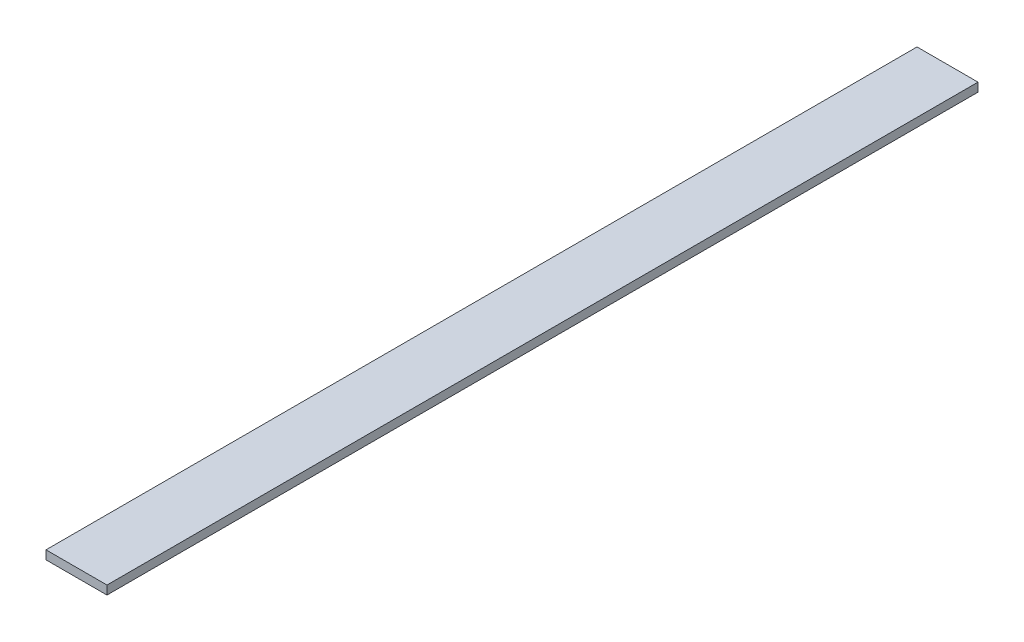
ISO-10303-21;
HEADER;
FILE_DESCRIPTION(('STEP AP214'),'2;1');
FILE_NAME('part.step','',(''),(''),'','','');
FILE_SCHEMA(('AUTOMOTIVE_DESIGN { 1 0 10303 214 1 1 1 1 }'));
ENDSEC;
DATA;
#1=APPLICATION_CONTEXT('core data for automotive mechanical design processes');
#2=APPLICATION_PROTOCOL_DEFINITION('international standard','automotive_design',2000,#1);
#3=PRODUCT_CONTEXT('',#1,'mechanical');
#4=PRODUCT('Part','Part','',(#3));
#5=PRODUCT_RELATED_PRODUCT_CATEGORY('part','',(#4));
#6=PRODUCT_DEFINITION_FORMATION('','',#4);
#7=PRODUCT_DEFINITION_CONTEXT('part definition',#1,'design');
#8=PRODUCT_DEFINITION('design','',#6,#7);
#9=PRODUCT_DEFINITION_SHAPE('','',#8);
#10=(LENGTH_UNIT() NAMED_UNIT(*) SI_UNIT(.MILLI.,.METRE.));
#11=(NAMED_UNIT(*) PLANE_ANGLE_UNIT() SI_UNIT($,.RADIAN.));
#12=(NAMED_UNIT(*) SI_UNIT($,.STERADIAN.) SOLID_ANGLE_UNIT());
#13=UNCERTAINTY_MEASURE_WITH_UNIT(LENGTH_MEASURE(1.E-05),#10,'distance_accuracy_value','');
#14=(GEOMETRIC_REPRESENTATION_CONTEXT(3) GLOBAL_UNCERTAINTY_ASSIGNED_CONTEXT((#13)) GLOBAL_UNIT_ASSIGNED_CONTEXT((#10,
#11,#12)) REPRESENTATION_CONTEXT('',''));
#15=CARTESIAN_POINT('',(0.,0.,0.));
#16=DIRECTION('',(0.,0.,1.));
#17=DIRECTION('',(1.,0.,0.));
#18=AXIS2_PLACEMENT_3D('',#15,#16,#17);
#19=CARTESIAN_POINT('',(17.5,0.,0.));
#20=DIRECTION('',(-1.,0.,0.));
#21=DIRECTION('',(0.,0.,1.));
#22=AXIS2_PLACEMENT_3D('',#19,#20,#21);
#23=PLANE('',#22);
#24=DIRECTION('',(0.,-1.,0.));
#25=VECTOR('',#24,1.);
#26=CARTESIAN_POINT('',(17.5,2.5,0.));
#27=LINE('',#26,#25);
#28=CARTESIAN_POINT('',(17.5,5.,0.));
#29=VERTEX_POINT('',#28);
#30=CARTESIAN_POINT('',(17.5,0.,0.));
#31=VERTEX_POINT('',#30);
#32=EDGE_CURVE('E51',#29,#31,#27,.T.);
#33=ORIENTED_EDGE('',*,*,#32,.F.);
#34=DIRECTION('',(0.,0.,-1.));
#35=VECTOR('',#34,1.);
#36=CARTESIAN_POINT('',(17.5,5.,250.));
#37=LINE('',#36,#35);
#38=CARTESIAN_POINT('',(17.5,5.,500.));
#39=VERTEX_POINT('',#38);
#40=EDGE_CURVE('E66',#39,#29,#37,.T.);
#41=ORIENTED_EDGE('',*,*,#40,.F.);
#42=DIRECTION('',(0.,-1.,0.));
#43=VECTOR('',#42,1.);
#44=CARTESIAN_POINT('',(17.5,2.5,500.));
#45=LINE('',#44,#43);
#46=CARTESIAN_POINT('',(17.5,0.,500.));
#47=VERTEX_POINT('',#46);
#48=EDGE_CURVE('E18',#39,#47,#45,.T.);
#49=ORIENTED_EDGE('',*,*,#48,.T.);
#50=DIRECTION('',(0.,0.,1.));
#51=VECTOR('',#50,1.);
#52=CARTESIAN_POINT('',(17.5,0.,250.));
#53=LINE('',#52,#51);
#54=EDGE_CURVE('E56',#31,#47,#53,.T.);
#55=ORIENTED_EDGE('',*,*,#54,.F.);
#56=EDGE_LOOP('',(#33,#41,#49,#55));
#57=FACE_BOUND('',#56,.T.);
#58=ADVANCED_FACE('F14',(#57),#23,.F.);
#59=CARTESIAN_POINT('',(17.5,0.,500.));
#60=DIRECTION('',(0.,0.,-1.));
#61=DIRECTION('',(-1.,0.,0.));
#62=AXIS2_PLACEMENT_3D('',#59,#60,#61);
#63=PLANE('',#62);
#64=DIRECTION('',(-1.,0.,0.));
#65=VECTOR('',#64,1.);
#66=CARTESIAN_POINT('',(0.,0.,500.));
#67=LINE('',#66,#65);
#68=CARTESIAN_POINT('',(-17.5,0.,500.));
#69=VERTEX_POINT('',#68);
#70=EDGE_CURVE('E61',#47,#69,#67,.T.);
#71=ORIENTED_EDGE('',*,*,#70,.F.);
#72=ORIENTED_EDGE('',*,*,#48,.F.);
#73=DIRECTION('',(1.,0.,0.));
#74=VECTOR('',#73,1.);
#75=CARTESIAN_POINT('',(0.,5.,500.));
#76=LINE('',#75,#74);
#77=CARTESIAN_POINT('',(-17.5,5.,500.));
#78=VERTEX_POINT('',#77);
#79=EDGE_CURVE('E79',#78,#39,#76,.T.);
#80=ORIENTED_EDGE('',*,*,#79,.F.);
#81=DIRECTION('',(0.,-1.,0.));
#82=VECTOR('',#81,1.);
#83=CARTESIAN_POINT('',(-17.5,2.5,500.));
#84=LINE('',#83,#82);
#85=EDGE_CURVE('E72',#78,#69,#84,.T.);
#86=ORIENTED_EDGE('',*,*,#85,.T.);
#87=EDGE_LOOP('',(#71,#72,#80,#86));
#88=FACE_BOUND('',#87,.T.);
#89=ADVANCED_FACE('F71',(#88),#63,.F.);
#90=CARTESIAN_POINT('',(-17.5,0.,500.));
#91=DIRECTION('',(0.,-1.,0.));
#92=DIRECTION('',(0.,0.,-1.));
#93=AXIS2_PLACEMENT_3D('',#90,#91,#92);
#94=PLANE('',#93);
#95=ORIENTED_EDGE('',*,*,#70,.T.);
#96=DIRECTION('',(0.,0.,-1.));
#97=VECTOR('',#96,1.);
#98=CARTESIAN_POINT('',(-17.5,0.,250.));
#99=LINE('',#98,#97);
#100=CARTESIAN_POINT('',(-17.5,0.,0.));
#101=VERTEX_POINT('',#100);
#102=EDGE_CURVE('E82',#69,#101,#99,.T.);
#103=ORIENTED_EDGE('',*,*,#102,.T.);
#104=DIRECTION('',(-1.,0.,0.));
#105=VECTOR('',#104,1.);
#106=CARTESIAN_POINT('',(0.,0.,0.));
#107=LINE('',#106,#105);
#108=EDGE_CURVE('E63',#31,#101,#107,.T.);
#109=ORIENTED_EDGE('',*,*,#108,.F.);
#110=ORIENTED_EDGE('',*,*,#54,.T.);
#111=EDGE_LOOP('',(#95,#103,#109,#110));
#112=FACE_BOUND('',#111,.T.);
#113=ADVANCED_FACE('F58',(#112),#94,.T.);
#114=CARTESIAN_POINT('',(17.5,0.,0.));
#115=DIRECTION('',(0.,0.,-1.));
#116=DIRECTION('',(-1.,0.,0.));
#117=AXIS2_PLACEMENT_3D('',#114,#115,#116);
#118=PLANE('',#117);
#119=ORIENTED_EDGE('',*,*,#32,.T.);
#120=ORIENTED_EDGE('',*,*,#108,.T.);
#121=DIRECTION('',(0.,1.,0.));
#122=VECTOR('',#121,1.);
#123=CARTESIAN_POINT('',(-17.5,2.5,0.));
#124=LINE('',#123,#122);
#125=CARTESIAN_POINT('',(-17.5,5.,0.));
#126=VERTEX_POINT('',#125);
#127=EDGE_CURVE('E24',#101,#126,#124,.T.);
#128=ORIENTED_EDGE('',*,*,#127,.T.);
#129=DIRECTION('',(-1.,0.,0.));
#130=VECTOR('',#129,1.);
#131=CARTESIAN_POINT('',(0.,5.,0.));
#132=LINE('',#131,#130);
#133=EDGE_CURVE('E32',#29,#126,#132,.T.);
#134=ORIENTED_EDGE('',*,*,#133,.F.);
#135=EDGE_LOOP('',(#119,#120,#128,#134));
#136=FACE_BOUND('',#135,.T.);
#137=ADVANCED_FACE('F86',(#136),#118,.T.);
#138=CARTESIAN_POINT('',(17.5,5.,0.));
#139=DIRECTION('',(0.,1.,0.));
#140=DIRECTION('',(-1.,0.,0.));
#141=AXIS2_PLACEMENT_3D('',#138,#139,#140);
#142=PLANE('',#141);
#143=DIRECTION('',(0.,0.,1.));
#144=VECTOR('',#143,1.);
#145=CARTESIAN_POINT('',(-17.5,5.,250.));
#146=LINE('',#145,#144);
#147=EDGE_CURVE('E9',#126,#78,#146,.T.);
#148=ORIENTED_EDGE('',*,*,#147,.T.);
#149=ORIENTED_EDGE('',*,*,#79,.T.);
#150=ORIENTED_EDGE('',*,*,#40,.T.);
#151=ORIENTED_EDGE('',*,*,#133,.T.);
#152=EDGE_LOOP('',(#148,#149,#150,#151));
#153=FACE_BOUND('',#152,.T.);
#154=ADVANCED_FACE('F88',(#153),#142,.T.);
#155=CARTESIAN_POINT('',(-17.5,0.,500.));
#156=DIRECTION('',(1.,0.,0.));
#157=DIRECTION('',(0.,0.,-1.));
#158=AXIS2_PLACEMENT_3D('',#155,#156,#157);
#159=PLANE('',#158);
#160=ORIENTED_EDGE('',*,*,#127,.F.);
#161=ORIENTED_EDGE('',*,*,#102,.F.);
#162=ORIENTED_EDGE('',*,*,#85,.F.);
#163=ORIENTED_EDGE('',*,*,#147,.F.);
#164=EDGE_LOOP('',(#160,#161,#162,#163));
#165=FACE_BOUND('',#164,.T.);
#166=ADVANCED_FACE('F16',(#165),#159,.F.);
#167=CLOSED_SHELL('',(#58,#89,#113,#137,#154,#166));
#168=MANIFOLD_SOLID_BREP('B1',#167);
#169=ADVANCED_BREP_SHAPE_REPRESENTATION('',(#18,#168),#14);
#170=SHAPE_DEFINITION_REPRESENTATION(#9,#169);
ENDSEC;
END-ISO-10303-21;
